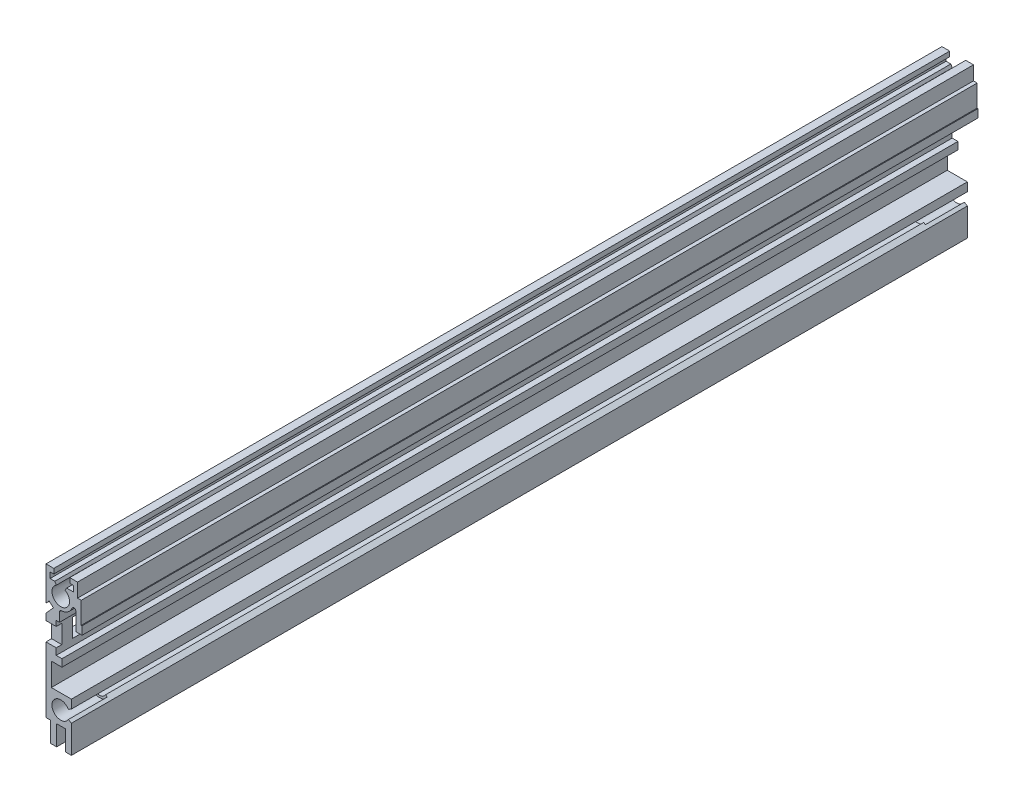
from build123d import *

# Parameters (mm, degrees)
EXTRUDE_1_DEPTH        = 218.74
CUT_EXTRUDE_1_REACH    = 222.757
SKETCH_2_W             = 7.5
SKETCH_2_H             = 4.5
PATTERN_LINEAR_1_COUNT = 21
PATTERN_LINEAR_1_PITCH = 10.16
SKETCH_3_R             = 2.15
CUT_EXTRUDE_2_DEPTH    = 9.5
CUT_EXTRUDE_START      = -9.5
SKETCH_4_R             = 2.15
CUT_EXTRUDE_3_DEPTH    = 9.5
SKETCH_5_W             = 1.36
SKETCH_5_H             = 4.5
CUT_EXTRUDE_4_DEPTH    = 10


with BuildPart() as part:
    # Sketch 1 → Extrude 1 (new body)
    with BuildSketch(Plane.XY):
        with BuildLine():
            Line((-2.5, -8.3), (-1, -8.3))
            Line((-1, -8.3), (-1, -3.4))
            Line((-1, -3.4), (1.1, -3.4))
            Line((1.1, -3.4), (1.1, -8.3))
            Line((1.1, -8.3), (2.6, -8.3))
            Line((2.6, -8.3), (2.6, -1.5011107))
            Line((2.6, -1.5011107), (1.428941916, -0.825))
            ThreePointArc((1.428941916, -0.825), (-1.65, 0), (1.428941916, 0.825))
            Line((1.428941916, 0.825), (2.6, 1.5011107))
            Line((2.6, 1.5011107), (2.6, 3.6))
            Line((2.6, 3.6), (-2.3, 3.6))
            Line((-2.3, 3.6), (-2.3, 9.2))
            Line((-2.3, 9.2), (0.3, 9.2))
            Line((0.3, 9.2), (0.3, 11))
            Line((0.3, 11), (-1.1, 11))
            Line((-1.1, 11), (-1.1, 18.4))
            Line((-1.1, 18.4), (-0.3, 18.4))
            Line((-0.3, 18.4), (-0.3, 20.55580198))
            ThreePointArc((-0.3, 20.55580198), (-0.163656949, 20.898954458), (0.171014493, 21.054961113))
            ThreePointArc((0.171014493, 21.054961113), (1.720972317, 21.604012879), (2.736231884, 22.897486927))
            ThreePointArc((2.736231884, 22.897486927), (3.295173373, 23.201478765), (3.7, 22.710620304))
            Line((3.7, 22.710620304), (3.7, 18.4))
            Line((3.7, 18.4), (5.2, 18.4))
            Line((5.2, 18.4), (5.2, 20.4))
            Line((5.2, 20.4), (5, 20.4))
            Line((5, 20.4), (5, 25.7))
            Line((5, 25.7), (4.1, 25.7))
            Line((4.1, 25.7), (4.1, 29.1))
            Line((4.1, 29.1), (2.2, 29.1))
            Line((2.2, 29.1), (2.2, 27.9))
            Line((2.2, 27.9), (3.1, 27.9))
            Line((3.1, 27.9), (3.1, 26.5))
            Line((3.1, 26.5), (1.443375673, 26.5))
            Line((1.443375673, 26.5), (0.825, 25.428941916))
            ThreePointArc((0.825, 25.428941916), (0, 22.35), (-0.825, 25.428941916))
            Line((-0.825, 25.428941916), (-1.443375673, 26.5))
            Line((-1.443375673, 26.5), (-2.6, 26.5))
            Line((-2.6, 26.5), (-2.6, 27.9))
            Line((-2.6, 27.9), (-1.7, 27.9))
            Line((-1.7, 27.9), (-1.7, 29.1))
            Line((-1.7, 29.1), (-3.6, 29.1))
            Line((-3.6, 29.1), (-3.6, 20.792785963))
            Line((-3.6, 20.792785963), (-2.840611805, 21.636550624))
            Line((-2.840611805, 21.636550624), (-1.8, 20.7))
            Line((-1.8, 20.7), (-3.6, 18.7))
            Line((-3.6, 18.7), (-3.6, -3.4))
            Line((-3.6, -3.4), (-2.5, -3.4))
            Line((-2.5, -3.4), (-2.5, -8.3))
        make_face()
    extrude(amount=-EXTRUDE_1_DEPTH)

    # Sketch 2 → Cut-Extrude 1 (cut, up to next)
    with BuildSketch(Plane(origin=(-1.1, 0, 0), x_dir=(0, 0, -1), z_dir=(1, 0, 0)), mode=Mode.PRIVATE) as cut_extrude_1_sk1:
        with Locations((7.77, 14.85)):
            Rectangle(SKETCH_2_W, SKETCH_2_H)
    cut_extrude_1_tool1 = extrude(cut_extrude_1_sk1.sketch, amount=-CUT_EXTRUDE_1_REACH, mode=Mode.PRIVATE) & part.part
    cut_extrude_1 = cut_extrude_1_tool1.solids().sort_by_distance((-1.1, 14.85, -7.77))[0]
    add(cut_extrude_1, mode=Mode.SUBTRACT)

    # Pattern Linear 1: Cut-Extrude 1 ×21
    with Locations(*[(0, 0, -i * PATTERN_LINEAR_1_PITCH) for i in range(1, PATTERN_LINEAR_1_COUNT)]):
        add(cut_extrude_1, mode=Mode.SUBTRACT)

    # Sketch 3 → Cut-Extrude 2 (cut)
    with BuildSketch(Plane.XY):
        Circle(SKETCH_3_R)
        with Locations((0, 24)):
            Circle(SKETCH_3_R)
    extrude(amount=-CUT_EXTRUDE_2_DEPTH, mode=Mode.SUBTRACT)

    # Sketch 4 → Cut-Extrude 3 (cut)
    with BuildSketch(Plane(origin=(0, 0, -218.74), x_dir=(-1, 0, 0), z_dir=(0, 0, -1)).offset(CUT_EXTRUDE_START)):
        Circle(SKETCH_4_R)
        with Locations((0, 24)):
            Circle(SKETCH_4_R)
    extrude(amount=CUT_EXTRUDE_3_DEPTH, mode=Mode.SUBTRACT)

    # Sketch 5 → Cut-Extrude 4 (cut)
    with BuildSketch(Plane.ZY.offset(3.6)):
        with Locations((-0.68, 14.85)):
            Rectangle(SKETCH_5_W, SKETCH_5_H)
        with Locations((-218.06, 14.85)):
            Rectangle(SKETCH_5_W, SKETCH_5_H)
    extrude(amount=-CUT_EXTRUDE_4_DEPTH, mode=Mode.SUBTRACT)


solid = part.part
